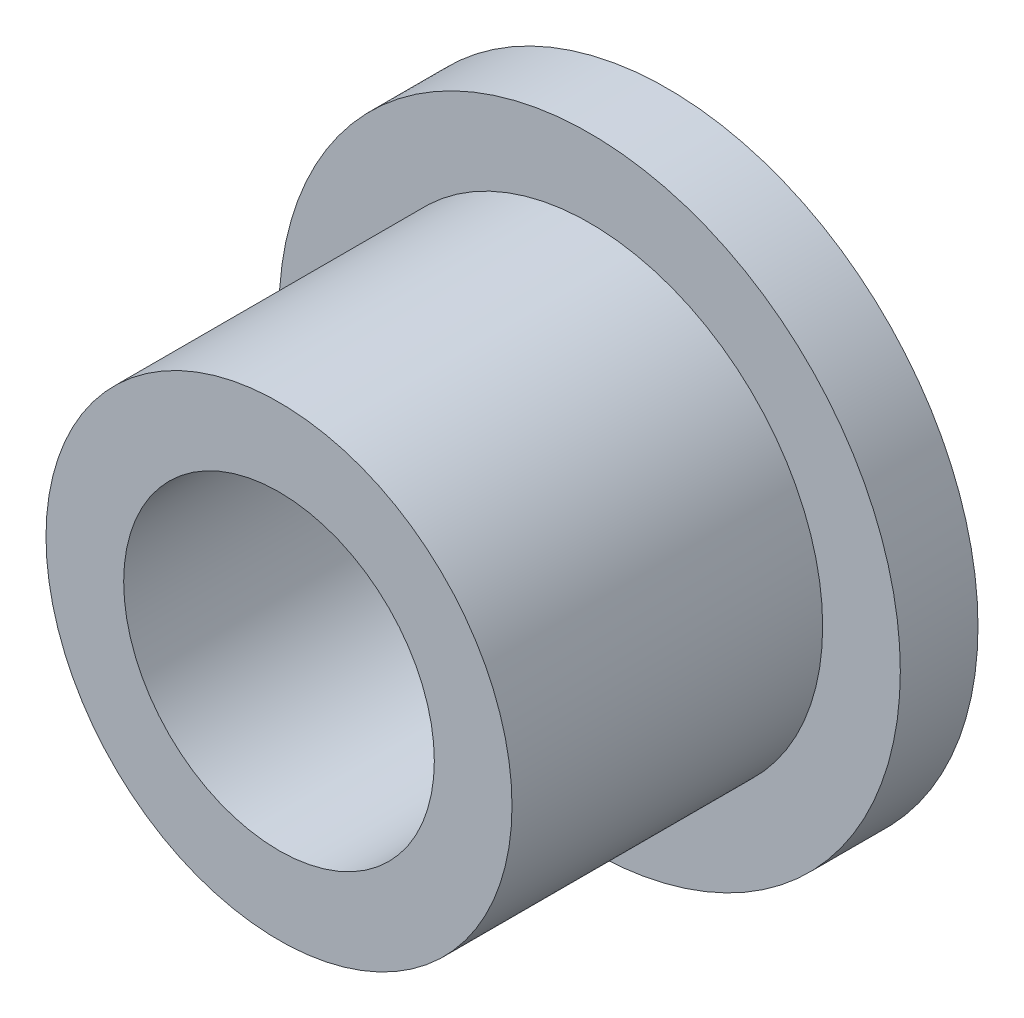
from build123d import *

# Parameters (mm, degrees)
CROQUIS1_R                       = 8
EXTRUIR1_DEPTH                   = 2
CROQUIS2_R                       = 6
EXTRUIR2_DEPTH                   = 8
TALADRO_DE_DI_METRO_DE_8_0_8_1_D = 8


with BuildPart() as part:
    # Croquis1 → Extruir1 (new body)
    with BuildSketch(Plane.XY):
        Circle(CROQUIS1_R)
    extrude(amount=EXTRUIR1_DEPTH)

    # Croquis2 → Extruir2 (add)
    with BuildSketch(Plane.XY.offset(2)):
        Circle(CROQUIS2_R)
    extrude(amount=EXTRUIR2_DEPTH)

    # Taladro de di_metro de _8.0 _8_1 (through all)
    with Locations(Plane.XY.offset(10)):
        with Locations((0, 0)):
            Hole(TALADRO_DE_DI_METRO_DE_8_0_8_1_D / 2)


solid = part.part
